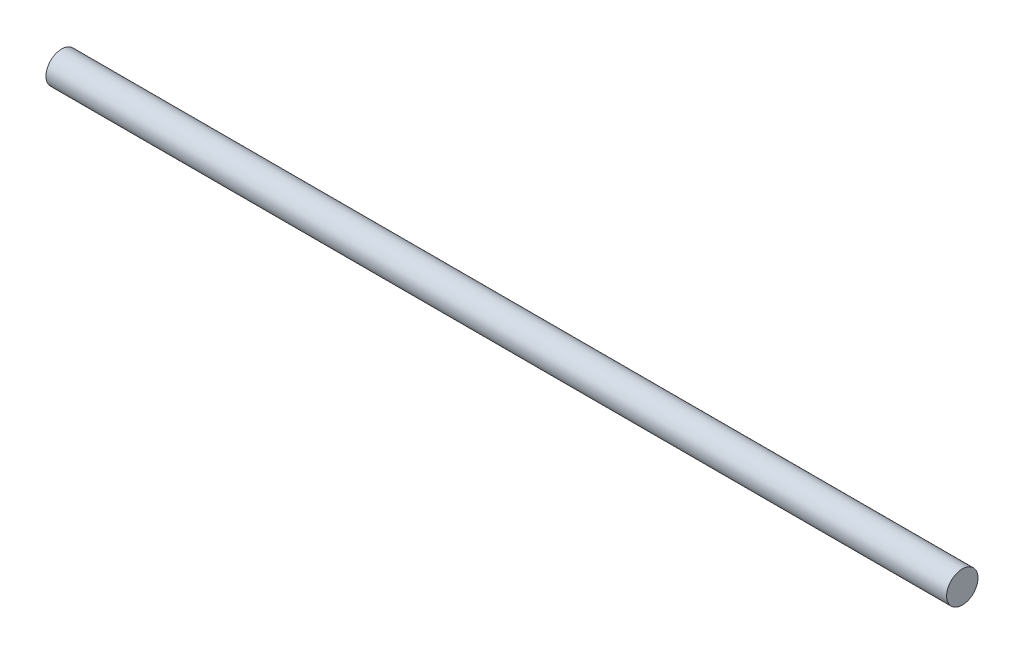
from build123d import *

# Parameters (mm, degrees)
SKETCH2_R = 3


with BuildPart() as part:
    # Sweep1: sweep along a path in Sketch1
    with BuildLine(Plane.XY) as sweep1_path:
        Line((0, 0), (172.02, 0))
    # Sketch2 → Sweep1 (sweep)
    with BuildSketch(Plane(origin=(0, 0, 0), x_dir=(0, 0, -1), z_dir=(1, 0, 0))):
        Circle(SKETCH2_R)
    sweep(path=sweep1_path.line)


solid = part.part
